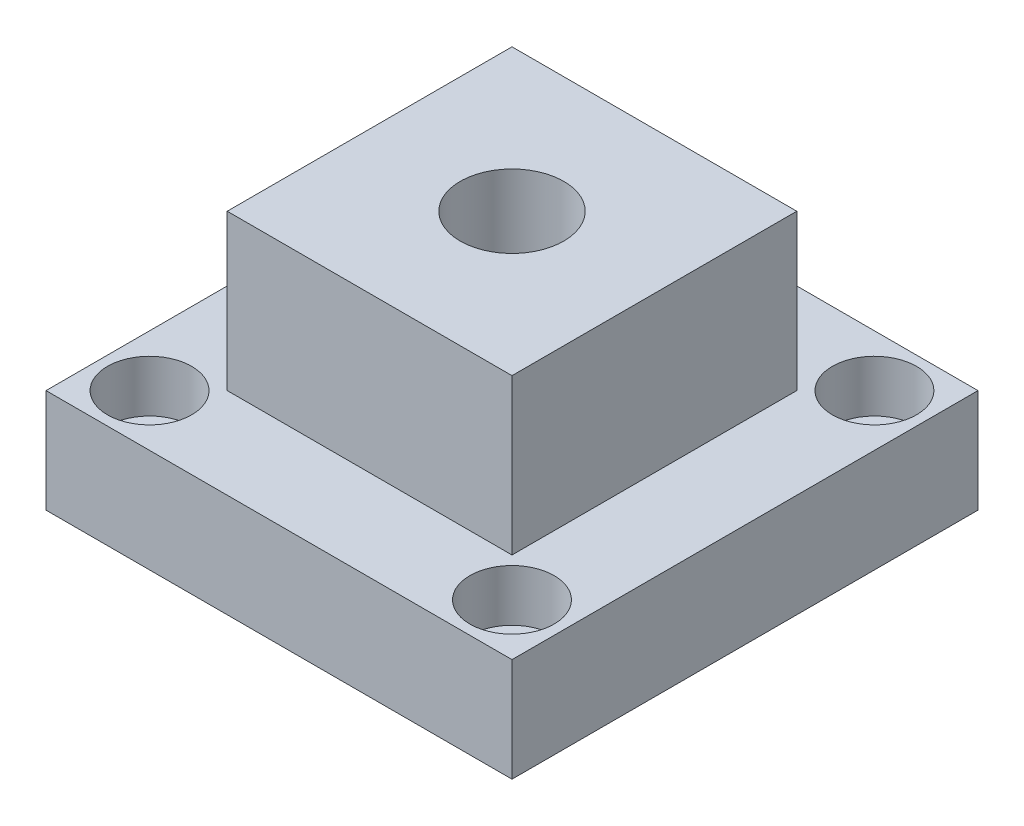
ISO-10303-21;
HEADER;
FILE_DESCRIPTION(('STEP AP214'),'2;1');
FILE_NAME('part.step','',(''),(''),'','','');
FILE_SCHEMA(('AUTOMOTIVE_DESIGN { 1 0 10303 214 1 1 1 1 }'));
ENDSEC;
DATA;
#1=APPLICATION_CONTEXT('core data for automotive mechanical design processes');
#2=APPLICATION_PROTOCOL_DEFINITION('international standard','automotive_design',2000,#1);
#3=PRODUCT_CONTEXT('',#1,'mechanical');
#4=PRODUCT('Part','Part','',(#3));
#5=PRODUCT_RELATED_PRODUCT_CATEGORY('part','',(#4));
#6=PRODUCT_DEFINITION_FORMATION('','',#4);
#7=PRODUCT_DEFINITION_CONTEXT('part definition',#1,'design');
#8=PRODUCT_DEFINITION('design','',#6,#7);
#9=PRODUCT_DEFINITION_SHAPE('','',#8);
#10=(LENGTH_UNIT() NAMED_UNIT(*) SI_UNIT(.MILLI.,.METRE.));
#11=(NAMED_UNIT(*) PLANE_ANGLE_UNIT() SI_UNIT($,.RADIAN.));
#12=(NAMED_UNIT(*) SI_UNIT($,.STERADIAN.) SOLID_ANGLE_UNIT());
#13=UNCERTAINTY_MEASURE_WITH_UNIT(LENGTH_MEASURE(1.E-05),#10,'distance_accuracy_value','');
#14=(GEOMETRIC_REPRESENTATION_CONTEXT(3) GLOBAL_UNCERTAINTY_ASSIGNED_CONTEXT((#13)) GLOBAL_UNIT_ASSIGNED_CONTEXT((#10,
#11,#12)) REPRESENTATION_CONTEXT('',''));
#15=CARTESIAN_POINT('',(0.,0.,0.));
#16=DIRECTION('',(0.,0.,1.));
#17=DIRECTION('',(1.,0.,0.));
#18=AXIS2_PLACEMENT_3D('',#15,#16,#17);
#19=CARTESIAN_POINT('',(1.38777878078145E-13,25.4,-114.300000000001));
#20=DIRECTION('',(0.,-1.,0.));
#21=DIRECTION('',(0.,0.,-1.));
#22=AXIS2_PLACEMENT_3D('',#19,#20,#21);
#23=PLANE('',#22);
#24=DIRECTION('',(0.,0.,1.));
#25=VECTOR('',#24,1.);
#26=CARTESIAN_POINT('',(0.,25.4,0.));
#27=LINE('',#26,#25);
#28=CARTESIAN_POINT('',(1.38777878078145E-13,25.4,-114.300000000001));
#29=VERTEX_POINT('',#28);
#30=CARTESIAN_POINT('',(0.,25.4,0.));
#31=VERTEX_POINT('',#30);
#32=EDGE_CURVE('E216',#29,#31,#27,.T.);
#33=ORIENTED_EDGE('',*,*,#32,.T.);
#34=DIRECTION('',(1.,0.,0.));
#35=VECTOR('',#34,1.);
#36=CARTESIAN_POINT('',(0.,25.4,0.));
#37=LINE('',#36,#35);
#38=CARTESIAN_POINT('',(114.300000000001,25.4,-1.38777878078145E-13));
#39=VERTEX_POINT('',#38);
#40=EDGE_CURVE('E219',#31,#39,#37,.T.);
#41=ORIENTED_EDGE('',*,*,#40,.T.);
#42=DIRECTION('',(0.,0.,-1.));
#43=VECTOR('',#42,1.);
#44=CARTESIAN_POINT('',(114.300000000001,25.4,-1.38777878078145E-13));
#45=LINE('',#44,#43);
#46=CARTESIAN_POINT('',(114.300000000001,25.4,-114.300000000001));
#47=VERTEX_POINT('',#46);
#48=EDGE_CURVE('E222',#39,#47,#45,.T.);
#49=ORIENTED_EDGE('',*,*,#48,.T.);
#50=DIRECTION('',(-1.,0.,0.));
#51=VECTOR('',#50,1.);
#52=CARTESIAN_POINT('',(1.38777878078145E-13,25.4,-114.300000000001));
#53=LINE('',#52,#51);
#54=EDGE_CURVE('E224',#47,#29,#53,.T.);
#55=ORIENTED_EDGE('',*,*,#54,.T.);
#56=EDGE_LOOP('',(#33,#41,#49,#55));
#57=FACE_BOUND('',#56,.T.);
#58=CARTESIAN_POINT('',(101.600000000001,25.4,-101.600000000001));
#59=DIRECTION('',(0.,1.,0.));
#60=DIRECTION('',(0.,0.,1.));
#61=AXIS2_PLACEMENT_3D('',#58,#59,#60);
#62=CIRCLE('',#61,10.31875);
#63=CARTESIAN_POINT('',(101.600000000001,25.4,-91.2812500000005));
#64=VERTEX_POINT('',#63);
#65=EDGE_CURVE('E200',#64,#64,#62,.T.);
#66=ORIENTED_EDGE('',*,*,#65,.F.);
#67=EDGE_LOOP('',(#66));
#68=FACE_BOUND('',#67,.T.);
#69=CARTESIAN_POINT('',(12.7000000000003,25.4,-101.600000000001));
#70=DIRECTION('',(0.,1.,0.));
#71=DIRECTION('',(0.,0.,1.));
#72=AXIS2_PLACEMENT_3D('',#69,#70,#71);
#73=CIRCLE('',#72,10.31875);
#74=CARTESIAN_POINT('',(12.7000000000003,25.4,-91.2812500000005));
#75=VERTEX_POINT('',#74);
#76=EDGE_CURVE('E185',#75,#75,#73,.T.);
#77=ORIENTED_EDGE('',*,*,#76,.F.);
#78=EDGE_LOOP('',(#77));
#79=FACE_BOUND('',#78,.T.);
#80=CARTESIAN_POINT('',(101.600000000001,25.4,-12.7000000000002));
#81=DIRECTION('',(0.,1.,0.));
#82=DIRECTION('',(0.,0.,1.));
#83=AXIS2_PLACEMENT_3D('',#80,#81,#82);
#84=CIRCLE('',#83,10.31875);
#85=CARTESIAN_POINT('',(101.600000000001,25.4,-2.38125000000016));
#86=VERTEX_POINT('',#85);
#87=EDGE_CURVE('E170',#86,#86,#84,.T.);
#88=ORIENTED_EDGE('',*,*,#87,.F.);
#89=EDGE_LOOP('',(#88));
#90=FACE_BOUND('',#89,.T.);
#91=CARTESIAN_POINT('',(12.7000000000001,25.4,-12.7000000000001));
#92=DIRECTION('',(0.,1.,0.));
#93=DIRECTION('',(0.,0.,1.));
#94=AXIS2_PLACEMENT_3D('',#91,#92,#93);
#95=CIRCLE('',#94,10.31875);
#96=CARTESIAN_POINT('',(12.7000000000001,25.4,-2.38125000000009));
#97=VERTEX_POINT('',#96);
#98=EDGE_CURVE('E155',#97,#97,#95,.T.);
#99=ORIENTED_EDGE('',*,*,#98,.F.);
#100=EDGE_LOOP('',(#99));
#101=FACE_BOUND('',#100,.T.);
#102=DIRECTION('',(0.,0.,1.));
#103=VECTOR('',#102,1.);
#104=CARTESIAN_POINT('',(22.2250000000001,25.4,-22.2250000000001));
#105=LINE('',#104,#103);
#106=CARTESIAN_POINT('',(22.2250000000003,25.4,-92.0750000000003));
#107=VERTEX_POINT('',#106);
#108=CARTESIAN_POINT('',(22.2250000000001,25.4,-22.2250000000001));
#109=VERTEX_POINT('',#108);
#110=EDGE_CURVE('E120',#107,#109,#105,.T.);
#111=ORIENTED_EDGE('',*,*,#110,.F.);
#112=DIRECTION('',(-1.,0.,0.));
#113=VECTOR('',#112,1.);
#114=CARTESIAN_POINT('',(22.2250000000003,25.4,-92.0750000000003));
#115=LINE('',#114,#113);
#116=CARTESIAN_POINT('',(92.0750000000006,25.4,-92.0750000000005));
#117=VERTEX_POINT('',#116);
#118=EDGE_CURVE('E134',#117,#107,#115,.T.);
#119=ORIENTED_EDGE('',*,*,#118,.F.);
#120=DIRECTION('',(0.,0.,-1.));
#121=VECTOR('',#120,1.);
#122=CARTESIAN_POINT('',(92.0750000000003,25.4,-22.2250000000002));
#123=LINE('',#122,#121);
#124=CARTESIAN_POINT('',(92.0750000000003,25.4,-22.2250000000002));
#125=VERTEX_POINT('',#124);
#126=EDGE_CURVE('E66',#125,#117,#123,.T.);
#127=ORIENTED_EDGE('',*,*,#126,.F.);
#128=DIRECTION('',(1.,0.,0.));
#129=VECTOR('',#128,1.);
#130=CARTESIAN_POINT('',(22.2250000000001,25.4,-22.2250000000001));
#131=LINE('',#130,#129);
#132=EDGE_CURVE('E61',#109,#125,#131,.T.);
#133=ORIENTED_EDGE('',*,*,#132,.F.);
#134=EDGE_LOOP('',(#111,#119,#127,#133));
#135=FACE_BOUND('',#134,.T.);
#136=ADVANCED_FACE('F46',(#57,#68,#79,#90,#101,#135),#23,.F.);
#137=CARTESIAN_POINT('',(0.,25.4,0.));
#138=DIRECTION('',(1.,0.,0.));
#139=DIRECTION('',(0.,0.,-1.));
#140=AXIS2_PLACEMENT_3D('',#137,#138,#139);
#141=PLANE('',#140);
#142=DIRECTION('',(0.,0.,1.));
#143=VECTOR('',#142,1.);
#144=CARTESIAN_POINT('',(0.,0.,0.));
#145=LINE('',#144,#143);
#146=CARTESIAN_POINT('',(1.38777878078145E-13,0.,-114.300000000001));
#147=VERTEX_POINT('',#146);
#148=CARTESIAN_POINT('',(0.,0.,0.));
#149=VERTEX_POINT('',#148);
#150=EDGE_CURVE('E215',#147,#149,#145,.T.);
#151=ORIENTED_EDGE('',*,*,#150,.T.);
#152=DIRECTION('',(0.,-1.,0.));
#153=VECTOR('',#152,1.);
#154=CARTESIAN_POINT('',(0.,25.4,0.));
#155=LINE('',#154,#153);
#156=EDGE_CURVE('E13',#31,#149,#155,.T.);
#157=ORIENTED_EDGE('',*,*,#156,.F.);
#158=ORIENTED_EDGE('',*,*,#32,.F.);
#159=DIRECTION('',(0.,-1.,0.));
#160=VECTOR('',#159,1.);
#161=CARTESIAN_POINT('',(1.38777878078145E-13,25.4,-114.300000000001));
#162=LINE('',#161,#160);
#163=EDGE_CURVE('E226',#29,#147,#162,.T.);
#164=ORIENTED_EDGE('',*,*,#163,.T.);
#165=EDGE_LOOP('',(#151,#157,#158,#164));
#166=FACE_BOUND('',#165,.T.);
#167=ADVANCED_FACE('F48',(#166),#141,.F.);
#168=CARTESIAN_POINT('',(0.,25.4,0.));
#169=DIRECTION('',(0.,0.,-1.));
#170=DIRECTION('',(-1.,0.,0.));
#171=AXIS2_PLACEMENT_3D('',#168,#169,#170);
#172=PLANE('',#171);
#173=DIRECTION('',(1.,0.,0.));
#174=VECTOR('',#173,1.);
#175=CARTESIAN_POINT('',(0.,0.,0.));
#176=LINE('',#175,#174);
#177=CARTESIAN_POINT('',(114.300000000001,0.,-1.38777878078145E-13));
#178=VERTEX_POINT('',#177);
#179=EDGE_CURVE('E229',#149,#178,#176,.T.);
#180=ORIENTED_EDGE('',*,*,#179,.T.);
#181=DIRECTION('',(0.,-1.,0.));
#182=VECTOR('',#181,1.);
#183=CARTESIAN_POINT('',(114.300000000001,25.4,-1.38777878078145E-13));
#184=LINE('',#183,#182);
#185=EDGE_CURVE('E54',#39,#178,#184,.T.);
#186=ORIENTED_EDGE('',*,*,#185,.F.);
#187=ORIENTED_EDGE('',*,*,#40,.F.);
#188=ORIENTED_EDGE('',*,*,#156,.T.);
#189=EDGE_LOOP('',(#180,#186,#187,#188));
#190=FACE_BOUND('',#189,.T.);
#191=ADVANCED_FACE('F259',(#190),#172,.F.);
#192=CARTESIAN_POINT('',(114.300000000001,25.4,-1.38777878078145E-13));
#193=DIRECTION('',(-1.,0.,0.));
#194=DIRECTION('',(0.,0.,1.));
#195=AXIS2_PLACEMENT_3D('',#192,#193,#194);
#196=PLANE('',#195);
#197=DIRECTION('',(0.,0.,-1.));
#198=VECTOR('',#197,1.);
#199=CARTESIAN_POINT('',(114.300000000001,0.,-1.38777878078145E-13));
#200=LINE('',#199,#198);
#201=CARTESIAN_POINT('',(114.300000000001,0.,-114.300000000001));
#202=VERTEX_POINT('',#201);
#203=EDGE_CURVE('E231',#178,#202,#200,.T.);
#204=ORIENTED_EDGE('',*,*,#203,.T.);
#205=DIRECTION('',(0.,-1.,0.));
#206=VECTOR('',#205,1.);
#207=CARTESIAN_POINT('',(114.300000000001,25.4,-114.300000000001));
#208=LINE('',#207,#206);
#209=EDGE_CURVE('E236',#47,#202,#208,.T.);
#210=ORIENTED_EDGE('',*,*,#209,.F.);
#211=ORIENTED_EDGE('',*,*,#48,.F.);
#212=ORIENTED_EDGE('',*,*,#185,.T.);
#213=EDGE_LOOP('',(#204,#210,#211,#212));
#214=FACE_BOUND('',#213,.T.);
#215=ADVANCED_FACE('F243',(#214),#196,.F.);
#216=CARTESIAN_POINT('',(1.38777878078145E-13,25.4,-114.300000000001));
#217=DIRECTION('',(0.,0.,1.));
#218=DIRECTION('',(1.,0.,0.));
#219=AXIS2_PLACEMENT_3D('',#216,#217,#218);
#220=PLANE('',#219);
#221=DIRECTION('',(-1.,0.,0.));
#222=VECTOR('',#221,1.);
#223=CARTESIAN_POINT('',(1.38777878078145E-13,0.,-114.300000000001));
#224=LINE('',#223,#222);
#225=EDGE_CURVE('E220',#202,#147,#224,.T.);
#226=ORIENTED_EDGE('',*,*,#225,.T.);
#227=ORIENTED_EDGE('',*,*,#163,.F.);
#228=ORIENTED_EDGE('',*,*,#54,.F.);
#229=ORIENTED_EDGE('',*,*,#209,.T.);
#230=EDGE_LOOP('',(#226,#227,#228,#229));
#231=FACE_BOUND('',#230,.T.);
#232=ADVANCED_FACE('F252',(#231),#220,.F.);
#233=CARTESIAN_POINT('',(1.38777878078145E-13,0.,-114.300000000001));
#234=DIRECTION('',(0.,-1.,0.));
#235=DIRECTION('',(0.,0.,-1.));
#236=AXIS2_PLACEMENT_3D('',#233,#234,#235);
#237=PLANE('',#236);
#238=CARTESIAN_POINT('',(12.7000000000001,0.,-12.7000000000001));
#239=DIRECTION('',(0.,1.,0.));
#240=DIRECTION('',(0.,0.,1.));
#241=AXIS2_PLACEMENT_3D('',#238,#239,#240);
#242=CIRCLE('',#241,7.58062999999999);
#243=CARTESIAN_POINT('',(12.7000000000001,0.,-5.11937000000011));
#244=VERTEX_POINT('',#243);
#245=EDGE_CURVE('E167',#244,#244,#242,.T.);
#246=ORIENTED_EDGE('',*,*,#245,.T.);
#247=EDGE_LOOP('',(#246));
#248=FACE_BOUND('',#247,.T.);
#249=CARTESIAN_POINT('',(101.600000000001,0.,-12.7000000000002));
#250=DIRECTION('',(0.,1.,0.));
#251=DIRECTION('',(0.,0.,1.));
#252=AXIS2_PLACEMENT_3D('',#249,#250,#251);
#253=CIRCLE('',#252,7.58062999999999);
#254=CARTESIAN_POINT('',(101.600000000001,0.,-5.11937000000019));
#255=VERTEX_POINT('',#254);
#256=EDGE_CURVE('E182',#255,#255,#253,.T.);
#257=ORIENTED_EDGE('',*,*,#256,.T.);
#258=EDGE_LOOP('',(#257));
#259=FACE_BOUND('',#258,.T.);
#260=CARTESIAN_POINT('',(12.7000000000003,0.,-101.600000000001));
#261=DIRECTION('',(0.,1.,0.));
#262=DIRECTION('',(0.,0.,1.));
#263=AXIS2_PLACEMENT_3D('',#260,#261,#262);
#264=CIRCLE('',#263,7.58062999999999);
#265=CARTESIAN_POINT('',(12.7000000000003,0.,-94.0193700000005));
#266=VERTEX_POINT('',#265);
#267=EDGE_CURVE('E197',#266,#266,#264,.T.);
#268=ORIENTED_EDGE('',*,*,#267,.T.);
#269=EDGE_LOOP('',(#268));
#270=FACE_BOUND('',#269,.T.);
#271=CARTESIAN_POINT('',(101.600000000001,0.,-101.600000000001));
#272=DIRECTION('',(0.,1.,0.));
#273=DIRECTION('',(0.,0.,1.));
#274=AXIS2_PLACEMENT_3D('',#271,#272,#273);
#275=CIRCLE('',#274,7.58062999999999);
#276=CARTESIAN_POINT('',(101.600000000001,0.,-94.0193700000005));
#277=VERTEX_POINT('',#276);
#278=EDGE_CURVE('E212',#277,#277,#275,.T.);
#279=ORIENTED_EDGE('',*,*,#278,.T.);
#280=EDGE_LOOP('',(#279));
#281=FACE_BOUND('',#280,.T.);
#282=ORIENTED_EDGE('',*,*,#150,.F.);
#283=ORIENTED_EDGE('',*,*,#225,.F.);
#284=ORIENTED_EDGE('',*,*,#203,.F.);
#285=ORIENTED_EDGE('',*,*,#179,.F.);
#286=EDGE_LOOP('',(#282,#283,#284,#285));
#287=FACE_BOUND('',#286,.T.);
#288=ADVANCED_FACE('F249',(#248,#259,#270,#281,#287),#237,.T.);
#289=CARTESIAN_POINT('',(101.600000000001,0.634999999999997,-101.600000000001));
#290=DIRECTION('',(0.,-1.,0.));
#291=DIRECTION('',(0.,0.,-1.));
#292=AXIS2_PLACEMENT_3D('',#289,#290,#291);
#293=CONICAL_SURFACE('',#292,6.94562999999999,0.78539816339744);
#294=ORIENTED_EDGE('',*,*,#278,.F.);
#295=EDGE_LOOP('',(#294));
#296=FACE_BOUND('',#295,.T.);
#297=CARTESIAN_POINT('',(101.600000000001,0.634999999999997,-101.600000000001));
#298=DIRECTION('',(0.,1.,0.));
#299=DIRECTION('',(0.,0.,1.));
#300=AXIS2_PLACEMENT_3D('',#297,#298,#299);
#301=CIRCLE('',#300,6.94562999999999);
#302=CARTESIAN_POINT('',(101.600000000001,0.634999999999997,-94.6543700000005));
#303=VERTEX_POINT('',#302);
#304=EDGE_CURVE('E209',#303,#303,#301,.T.);
#305=ORIENTED_EDGE('',*,*,#304,.T.);
#306=EDGE_LOOP('',(#305));
#307=FACE_BOUND('',#306,.T.);
#308=ADVANCED_FACE('F272',(#296,#307),#293,.F.);
#309=CARTESIAN_POINT('',(101.600000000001,25.4,-101.600000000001));
#310=DIRECTION('',(0.,1.,0.));
#311=DIRECTION('',(0.,0.,1.));
#312=AXIS2_PLACEMENT_3D('',#309,#310,#311);
#313=CYLINDRICAL_SURFACE('',#312,6.94562999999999);
#314=ORIENTED_EDGE('',*,*,#304,.F.);
#315=EDGE_LOOP('',(#314));
#316=FACE_BOUND('',#315,.T.);
#317=CARTESIAN_POINT('',(101.600000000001,12.7,-101.600000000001));
#318=DIRECTION('',(0.,1.,0.));
#319=DIRECTION('',(0.,0.,1.));
#320=AXIS2_PLACEMENT_3D('',#317,#318,#319);
#321=CIRCLE('',#320,6.94562999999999);
#322=CARTESIAN_POINT('',(101.600000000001,12.7,-94.6543700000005));
#323=VERTEX_POINT('',#322);
#324=EDGE_CURVE('E206',#323,#323,#321,.T.);
#325=ORIENTED_EDGE('',*,*,#324,.T.);
#326=EDGE_LOOP('',(#325));
#327=FACE_BOUND('',#326,.T.);
#328=ADVANCED_FACE('F292',(#316,#327),#313,.F.);
#329=CARTESIAN_POINT('',(108.545630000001,12.7,-101.600000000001));
#330=DIRECTION('',(0.,-1.,0.));
#331=DIRECTION('',(0.,0.,-1.));
#332=AXIS2_PLACEMENT_3D('',#329,#330,#331);
#333=PLANE('',#332);
#334=ORIENTED_EDGE('',*,*,#324,.F.);
#335=EDGE_LOOP('',(#334));
#336=FACE_BOUND('',#335,.T.);
#337=CARTESIAN_POINT('',(101.600000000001,12.7,-101.600000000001));
#338=DIRECTION('',(0.,1.,0.));
#339=DIRECTION('',(0.,0.,1.));
#340=AXIS2_PLACEMENT_3D('',#337,#338,#339);
#341=CIRCLE('',#340,10.31875);
#342=CARTESIAN_POINT('',(101.600000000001,12.7,-91.2812500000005));
#343=VERTEX_POINT('',#342);
#344=EDGE_CURVE('E203',#343,#343,#341,.T.);
#345=ORIENTED_EDGE('',*,*,#344,.T.);
#346=EDGE_LOOP('',(#345));
#347=FACE_BOUND('',#346,.T.);
#348=ADVANCED_FACE('F299',(#336,#347),#333,.F.);
#349=CARTESIAN_POINT('',(101.600000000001,25.4,-101.600000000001));
#350=DIRECTION('',(0.,1.,0.));
#351=DIRECTION('',(0.,0.,1.));
#352=AXIS2_PLACEMENT_3D('',#349,#350,#351);
#353=CYLINDRICAL_SURFACE('',#352,10.31875);
#354=ORIENTED_EDGE('',*,*,#344,.F.);
#355=EDGE_LOOP('',(#354));
#356=FACE_BOUND('',#355,.T.);
#357=ORIENTED_EDGE('',*,*,#65,.T.);
#358=EDGE_LOOP('',(#357));
#359=FACE_BOUND('',#358,.T.);
#360=ADVANCED_FACE('F306',(#356,#359),#353,.F.);
#361=CARTESIAN_POINT('',(12.7000000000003,0.634999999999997,-101.600000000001));
#362=DIRECTION('',(0.,-1.,0.));
#363=DIRECTION('',(0.,0.,-1.));
#364=AXIS2_PLACEMENT_3D('',#361,#362,#363);
#365=CONICAL_SURFACE('',#364,6.94562999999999,0.785398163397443);
#366=ORIENTED_EDGE('',*,*,#267,.F.);
#367=EDGE_LOOP('',(#366));
#368=FACE_BOUND('',#367,.T.);
#369=CARTESIAN_POINT('',(12.7000000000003,0.634999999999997,-101.600000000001));
#370=DIRECTION('',(0.,1.,0.));
#371=DIRECTION('',(0.,0.,1.));
#372=AXIS2_PLACEMENT_3D('',#369,#370,#371);
#373=CIRCLE('',#372,6.94562999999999);
#374=CARTESIAN_POINT('',(12.7000000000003,0.634999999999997,-94.6543700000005));
#375=VERTEX_POINT('',#374);
#376=EDGE_CURVE('E194',#375,#375,#373,.T.);
#377=ORIENTED_EDGE('',*,*,#376,.T.);
#378=EDGE_LOOP('',(#377));
#379=FACE_BOUND('',#378,.T.);
#380=ADVANCED_FACE('F314',(#368,#379),#365,.F.);
#381=CARTESIAN_POINT('',(12.7000000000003,25.4,-101.600000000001));
#382=DIRECTION('',(0.,1.,0.));
#383=DIRECTION('',(0.,0.,1.));
#384=AXIS2_PLACEMENT_3D('',#381,#382,#383);
#385=CYLINDRICAL_SURFACE('',#384,6.94563);
#386=ORIENTED_EDGE('',*,*,#376,.F.);
#387=EDGE_LOOP('',(#386));
#388=FACE_BOUND('',#387,.T.);
#389=CARTESIAN_POINT('',(12.7000000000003,12.7,-101.600000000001));
#390=DIRECTION('',(0.,1.,0.));
#391=DIRECTION('',(0.,0.,1.));
#392=AXIS2_PLACEMENT_3D('',#389,#390,#391);
#393=CIRCLE('',#392,6.94563);
#394=CARTESIAN_POINT('',(12.7000000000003,12.7,-94.6543700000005));
#395=VERTEX_POINT('',#394);
#396=EDGE_CURVE('E191',#395,#395,#393,.T.);
#397=ORIENTED_EDGE('',*,*,#396,.T.);
#398=EDGE_LOOP('',(#397));
#399=FACE_BOUND('',#398,.T.);
#400=ADVANCED_FACE('F322',(#388,#399),#385,.F.);
#401=CARTESIAN_POINT('',(19.6456300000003,12.7,-101.600000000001));
#402=DIRECTION('',(0.,-1.,0.));
#403=DIRECTION('',(0.,0.,-1.));
#404=AXIS2_PLACEMENT_3D('',#401,#402,#403);
#405=PLANE('',#404);
#406=ORIENTED_EDGE('',*,*,#396,.F.);
#407=EDGE_LOOP('',(#406));
#408=FACE_BOUND('',#407,.T.);
#409=CARTESIAN_POINT('',(12.7000000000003,12.7,-101.600000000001));
#410=DIRECTION('',(0.,1.,0.));
#411=DIRECTION('',(0.,0.,1.));
#412=AXIS2_PLACEMENT_3D('',#409,#410,#411);
#413=CIRCLE('',#412,10.31875);
#414=CARTESIAN_POINT('',(12.7000000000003,12.7,-91.2812500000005));
#415=VERTEX_POINT('',#414);
#416=EDGE_CURVE('E188',#415,#415,#413,.T.);
#417=ORIENTED_EDGE('',*,*,#416,.T.);
#418=EDGE_LOOP('',(#417));
#419=FACE_BOUND('',#418,.T.);
#420=ADVANCED_FACE('F330',(#408,#419),#405,.F.);
#421=CARTESIAN_POINT('',(12.7000000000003,25.4,-101.600000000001));
#422=DIRECTION('',(0.,1.,0.));
#423=DIRECTION('',(0.,0.,1.));
#424=AXIS2_PLACEMENT_3D('',#421,#422,#423);
#425=CYLINDRICAL_SURFACE('',#424,10.31875);
#426=ORIENTED_EDGE('',*,*,#416,.F.);
#427=EDGE_LOOP('',(#426));
#428=FACE_BOUND('',#427,.T.);
#429=ORIENTED_EDGE('',*,*,#76,.T.);
#430=EDGE_LOOP('',(#429));
#431=FACE_BOUND('',#430,.T.);
#432=ADVANCED_FACE('F338',(#428,#431),#425,.F.);
#433=CARTESIAN_POINT('',(101.600000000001,0.634999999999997,-12.7000000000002));
#434=DIRECTION('',(0.,-1.,0.));
#435=DIRECTION('',(0.,0.,-1.));
#436=AXIS2_PLACEMENT_3D('',#433,#434,#435);
#437=CONICAL_SURFACE('',#436,6.94562999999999,0.78539816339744);
#438=ORIENTED_EDGE('',*,*,#256,.F.);
#439=EDGE_LOOP('',(#438));
#440=FACE_BOUND('',#439,.T.);
#441=CARTESIAN_POINT('',(101.600000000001,0.634999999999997,-12.7000000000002));
#442=DIRECTION('',(0.,1.,0.));
#443=DIRECTION('',(0.,0.,1.));
#444=AXIS2_PLACEMENT_3D('',#441,#442,#443);
#445=CIRCLE('',#444,6.94562999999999);
#446=CARTESIAN_POINT('',(101.600000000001,0.634999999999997,-5.75437000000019));
#447=VERTEX_POINT('',#446);
#448=EDGE_CURVE('E179',#447,#447,#445,.T.);
#449=ORIENTED_EDGE('',*,*,#448,.T.);
#450=EDGE_LOOP('',(#449));
#451=FACE_BOUND('',#450,.T.);
#452=ADVANCED_FACE('F346',(#440,#451),#437,.F.);
#453=CARTESIAN_POINT('',(101.600000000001,25.4,-12.7000000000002));
#454=DIRECTION('',(0.,1.,0.));
#455=DIRECTION('',(0.,0.,1.));
#456=AXIS2_PLACEMENT_3D('',#453,#454,#455);
#457=CYLINDRICAL_SURFACE('',#456,6.94562999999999);
#458=ORIENTED_EDGE('',*,*,#448,.F.);
#459=EDGE_LOOP('',(#458));
#460=FACE_BOUND('',#459,.T.);
#461=CARTESIAN_POINT('',(101.600000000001,12.7,-12.7000000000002));
#462=DIRECTION('',(0.,1.,0.));
#463=DIRECTION('',(0.,0.,1.));
#464=AXIS2_PLACEMENT_3D('',#461,#462,#463);
#465=CIRCLE('',#464,6.94562999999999);
#466=CARTESIAN_POINT('',(101.600000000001,12.7,-5.75437000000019));
#467=VERTEX_POINT('',#466);
#468=EDGE_CURVE('E176',#467,#467,#465,.T.);
#469=ORIENTED_EDGE('',*,*,#468,.T.);
#470=EDGE_LOOP('',(#469));
#471=FACE_BOUND('',#470,.T.);
#472=ADVANCED_FACE('F354',(#460,#471),#457,.F.);
#473=CARTESIAN_POINT('',(108.545630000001,12.7,-12.7000000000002));
#474=DIRECTION('',(0.,-1.,0.));
#475=DIRECTION('',(0.,0.,-1.));
#476=AXIS2_PLACEMENT_3D('',#473,#474,#475);
#477=PLANE('',#476);
#478=ORIENTED_EDGE('',*,*,#468,.F.);
#479=EDGE_LOOP('',(#478));
#480=FACE_BOUND('',#479,.T.);
#481=CARTESIAN_POINT('',(101.600000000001,12.7,-12.7000000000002));
#482=DIRECTION('',(0.,1.,0.));
#483=DIRECTION('',(0.,0.,1.));
#484=AXIS2_PLACEMENT_3D('',#481,#482,#483);
#485=CIRCLE('',#484,10.31875);
#486=CARTESIAN_POINT('',(101.600000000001,12.7,-2.38125000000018));
#487=VERTEX_POINT('',#486);
#488=EDGE_CURVE('E173',#487,#487,#485,.T.);
#489=ORIENTED_EDGE('',*,*,#488,.T.);
#490=EDGE_LOOP('',(#489));
#491=FACE_BOUND('',#490,.T.);
#492=ADVANCED_FACE('F362',(#480,#491),#477,.F.);
#493=CARTESIAN_POINT('',(101.600000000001,25.4,-12.7000000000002));
#494=DIRECTION('',(0.,1.,0.));
#495=DIRECTION('',(0.,0.,1.));
#496=AXIS2_PLACEMENT_3D('',#493,#494,#495);
#497=CYLINDRICAL_SURFACE('',#496,10.31875);
#498=ORIENTED_EDGE('',*,*,#488,.F.);
#499=EDGE_LOOP('',(#498));
#500=FACE_BOUND('',#499,.T.);
#501=ORIENTED_EDGE('',*,*,#87,.T.);
#502=EDGE_LOOP('',(#501));
#503=FACE_BOUND('',#502,.T.);
#504=ADVANCED_FACE('F370',(#500,#503),#497,.F.);
#505=CARTESIAN_POINT('',(12.7000000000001,0.634999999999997,-12.7000000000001));
#506=DIRECTION('',(0.,-1.,0.));
#507=DIRECTION('',(0.,0.,-1.));
#508=AXIS2_PLACEMENT_3D('',#505,#506,#507);
#509=CONICAL_SURFACE('',#508,6.94562999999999,0.785398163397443);
#510=ORIENTED_EDGE('',*,*,#245,.F.);
#511=EDGE_LOOP('',(#510));
#512=FACE_BOUND('',#511,.T.);
#513=CARTESIAN_POINT('',(12.7000000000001,0.634999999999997,-12.7000000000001));
#514=DIRECTION('',(0.,1.,0.));
#515=DIRECTION('',(0.,0.,1.));
#516=AXIS2_PLACEMENT_3D('',#513,#514,#515);
#517=CIRCLE('',#516,6.94562999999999);
#518=CARTESIAN_POINT('',(12.7000000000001,0.634999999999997,-5.75437000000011));
#519=VERTEX_POINT('',#518);
#520=EDGE_CURVE('E164',#519,#519,#517,.T.);
#521=ORIENTED_EDGE('',*,*,#520,.T.);
#522=EDGE_LOOP('',(#521));
#523=FACE_BOUND('',#522,.T.);
#524=ADVANCED_FACE('F378',(#512,#523),#509,.F.);
#525=CARTESIAN_POINT('',(12.7000000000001,25.4,-12.7000000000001));
#526=DIRECTION('',(0.,1.,0.));
#527=DIRECTION('',(0.,0.,1.));
#528=AXIS2_PLACEMENT_3D('',#525,#526,#527);
#529=CYLINDRICAL_SURFACE('',#528,6.94563);
#530=ORIENTED_EDGE('',*,*,#520,.F.);
#531=EDGE_LOOP('',(#530));
#532=FACE_BOUND('',#531,.T.);
#533=CARTESIAN_POINT('',(12.7000000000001,12.7,-12.7000000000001));
#534=DIRECTION('',(0.,1.,0.));
#535=DIRECTION('',(0.,0.,1.));
#536=AXIS2_PLACEMENT_3D('',#533,#534,#535);
#537=CIRCLE('',#536,6.94563);
#538=CARTESIAN_POINT('',(12.7000000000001,12.7,-5.75437000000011));
#539=VERTEX_POINT('',#538);
#540=EDGE_CURVE('E161',#539,#539,#537,.T.);
#541=ORIENTED_EDGE('',*,*,#540,.T.);
#542=EDGE_LOOP('',(#541));
#543=FACE_BOUND('',#542,.T.);
#544=ADVANCED_FACE('F386',(#532,#543),#529,.F.);
#545=CARTESIAN_POINT('',(19.6456300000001,12.7,-12.7000000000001));
#546=DIRECTION('',(0.,-1.,0.));
#547=DIRECTION('',(0.,0.,-1.));
#548=AXIS2_PLACEMENT_3D('',#545,#546,#547);
#549=PLANE('',#548);
#550=ORIENTED_EDGE('',*,*,#540,.F.);
#551=EDGE_LOOP('',(#550));
#552=FACE_BOUND('',#551,.T.);
#553=CARTESIAN_POINT('',(12.7000000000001,12.7,-12.7000000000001));
#554=DIRECTION('',(0.,1.,0.));
#555=DIRECTION('',(0.,0.,1.));
#556=AXIS2_PLACEMENT_3D('',#553,#554,#555);
#557=CIRCLE('',#556,10.31875);
#558=CARTESIAN_POINT('',(12.7000000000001,12.7,-2.3812500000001));
#559=VERTEX_POINT('',#558);
#560=EDGE_CURVE('E158',#559,#559,#557,.T.);
#561=ORIENTED_EDGE('',*,*,#560,.T.);
#562=EDGE_LOOP('',(#561));
#563=FACE_BOUND('',#562,.T.);
#564=ADVANCED_FACE('F394',(#552,#563),#549,.F.);
#565=CARTESIAN_POINT('',(12.7000000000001,25.4,-12.7000000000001));
#566=DIRECTION('',(0.,1.,0.));
#567=DIRECTION('',(0.,0.,1.));
#568=AXIS2_PLACEMENT_3D('',#565,#566,#567);
#569=CYLINDRICAL_SURFACE('',#568,10.31875);
#570=ORIENTED_EDGE('',*,*,#560,.F.);
#571=EDGE_LOOP('',(#570));
#572=FACE_BOUND('',#571,.T.);
#573=ORIENTED_EDGE('',*,*,#98,.T.);
#574=EDGE_LOOP('',(#573));
#575=FACE_BOUND('',#574,.T.);
#576=ADVANCED_FACE('F402',(#572,#575),#569,.F.);
#577=CARTESIAN_POINT('',(22.2250000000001,63.5,-22.2250000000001));
#578=DIRECTION('',(1.,0.,0.));
#579=DIRECTION('',(0.,0.,-1.));
#580=AXIS2_PLACEMENT_3D('',#577,#578,#579);
#581=PLANE('',#580);
#582=ORIENTED_EDGE('',*,*,#110,.T.);
#583=DIRECTION('',(0.,-1.,0.));
#584=VECTOR('',#583,1.);
#585=CARTESIAN_POINT('',(22.2250000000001,63.5,-22.2250000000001));
#586=LINE('',#585,#584);
#587=CARTESIAN_POINT('',(22.2250000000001,63.5,-22.2250000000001));
#588=VERTEX_POINT('',#587);
#589=EDGE_CURVE('E153',#588,#109,#586,.T.);
#590=ORIENTED_EDGE('',*,*,#589,.F.);
#591=DIRECTION('',(0.,0.,1.));
#592=VECTOR('',#591,1.);
#593=CARTESIAN_POINT('',(22.2250000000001,63.5,-22.2250000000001));
#594=LINE('',#593,#592);
#595=CARTESIAN_POINT('',(22.2250000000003,63.5,-92.0750000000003));
#596=VERTEX_POINT('',#595);
#597=EDGE_CURVE('E130',#596,#588,#594,.T.);
#598=ORIENTED_EDGE('',*,*,#597,.F.);
#599=DIRECTION('',(0.,-1.,0.));
#600=VECTOR('',#599,1.);
#601=CARTESIAN_POINT('',(22.2250000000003,63.5,-92.0750000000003));
#602=LINE('',#601,#600);
#603=EDGE_CURVE('E139',#596,#107,#602,.T.);
#604=ORIENTED_EDGE('',*,*,#603,.T.);
#605=EDGE_LOOP('',(#582,#590,#598,#604));
#606=FACE_BOUND('',#605,.T.);
#607=ADVANCED_FACE('F410',(#606),#581,.F.);
#608=CARTESIAN_POINT('',(22.2250000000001,63.5,-22.2250000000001));
#609=DIRECTION('',(0.,0.,-1.));
#610=DIRECTION('',(-1.,0.,0.));
#611=AXIS2_PLACEMENT_3D('',#608,#609,#610);
#612=PLANE('',#611);
#613=ORIENTED_EDGE('',*,*,#132,.T.);
#614=DIRECTION('',(0.,-1.,0.));
#615=VECTOR('',#614,1.);
#616=CARTESIAN_POINT('',(92.0750000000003,63.5,-22.2250000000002));
#617=LINE('',#616,#615);
#618=CARTESIAN_POINT('',(92.0750000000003,63.5,-22.2250000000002));
#619=VERTEX_POINT('',#618);
#620=EDGE_CURVE('E150',#619,#125,#617,.T.);
#621=ORIENTED_EDGE('',*,*,#620,.F.);
#622=DIRECTION('',(1.,0.,0.));
#623=VECTOR('',#622,1.);
#624=CARTESIAN_POINT('',(22.2250000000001,63.5,-22.2250000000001));
#625=LINE('',#624,#623);
#626=EDGE_CURVE('E133',#588,#619,#625,.T.);
#627=ORIENTED_EDGE('',*,*,#626,.F.);
#628=ORIENTED_EDGE('',*,*,#589,.T.);
#629=EDGE_LOOP('',(#613,#621,#627,#628));
#630=FACE_BOUND('',#629,.T.);
#631=ADVANCED_FACE('F418',(#630),#612,.F.);
#632=CARTESIAN_POINT('',(92.0750000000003,63.5,-22.2250000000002));
#633=DIRECTION('',(-1.,0.,0.));
#634=DIRECTION('',(0.,0.,1.));
#635=AXIS2_PLACEMENT_3D('',#632,#633,#634);
#636=PLANE('',#635);
#637=ORIENTED_EDGE('',*,*,#126,.T.);
#638=DIRECTION('',(0.,-1.,0.));
#639=VECTOR('',#638,1.);
#640=CARTESIAN_POINT('',(92.0750000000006,63.5,-92.0750000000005));
#641=LINE('',#640,#639);
#642=CARTESIAN_POINT('',(92.0750000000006,63.5,-92.0750000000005));
#643=VERTEX_POINT('',#642);
#644=EDGE_CURVE('E147',#643,#117,#641,.T.);
#645=ORIENTED_EDGE('',*,*,#644,.F.);
#646=DIRECTION('',(0.,0.,-1.));
#647=VECTOR('',#646,1.);
#648=CARTESIAN_POINT('',(92.0750000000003,63.5,-22.2250000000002));
#649=LINE('',#648,#647);
#650=EDGE_CURVE('E136',#619,#643,#649,.T.);
#651=ORIENTED_EDGE('',*,*,#650,.F.);
#652=ORIENTED_EDGE('',*,*,#620,.T.);
#653=EDGE_LOOP('',(#637,#645,#651,#652));
#654=FACE_BOUND('',#653,.T.);
#655=ADVANCED_FACE('F426',(#654),#636,.F.);
#656=CARTESIAN_POINT('',(22.2250000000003,63.5,-92.0750000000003));
#657=DIRECTION('',(0.,0.,1.));
#658=DIRECTION('',(1.,0.,0.));
#659=AXIS2_PLACEMENT_3D('',#656,#657,#658);
#660=PLANE('',#659);
#661=ORIENTED_EDGE('',*,*,#118,.T.);
#662=ORIENTED_EDGE('',*,*,#603,.F.);
#663=DIRECTION('',(-1.,0.,0.));
#664=VECTOR('',#663,1.);
#665=CARTESIAN_POINT('',(22.2250000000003,63.5,-92.0750000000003));
#666=LINE('',#665,#664);
#667=EDGE_CURVE('E138',#643,#596,#666,.T.);
#668=ORIENTED_EDGE('',*,*,#667,.F.);
#669=ORIENTED_EDGE('',*,*,#644,.T.);
#670=EDGE_LOOP('',(#661,#662,#668,#669));
#671=FACE_BOUND('',#670,.T.);
#672=ADVANCED_FACE('F434',(#671),#660,.F.);
#673=CARTESIAN_POINT('',(22.2250000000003,63.5,-92.0750000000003));
#674=DIRECTION('',(0.,-1.,0.));
#675=DIRECTION('',(0.,0.,-1.));
#676=AXIS2_PLACEMENT_3D('',#673,#674,#675);
#677=PLANE('',#676);
#678=CARTESIAN_POINT('',(57.1500000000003,63.5,-57.1500000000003));
#679=DIRECTION('',(0.,1.,0.));
#680=DIRECTION('',(0.,0.,1.));
#681=AXIS2_PLACEMENT_3D('',#678,#679,#680);
#682=CIRCLE('',#681,12.7);
#683=CARTESIAN_POINT('',(57.1500000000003,63.5,-44.4500000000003));
#684=VERTEX_POINT('',#683);
#685=EDGE_CURVE('E555',#684,#684,#682,.T.);
#686=ORIENTED_EDGE('',*,*,#685,.F.);
#687=EDGE_LOOP('',(#686));
#688=FACE_BOUND('',#687,.T.);
#689=ORIENTED_EDGE('',*,*,#597,.T.);
#690=ORIENTED_EDGE('',*,*,#626,.T.);
#691=ORIENTED_EDGE('',*,*,#650,.T.);
#692=ORIENTED_EDGE('',*,*,#667,.T.);
#693=EDGE_LOOP('',(#689,#690,#691,#692));
#694=FACE_BOUND('',#693,.T.);
#695=ADVANCED_FACE('F114',(#688,#694),#677,.F.);
#696=CARTESIAN_POINT('',(57.1500000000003,31.75254,-57.1500000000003));
#697=DIRECTION('',(0.,1.,0.));
#698=DIRECTION('',(0.,0.,1.));
#699=AXIS2_PLACEMENT_3D('',#696,#697,#698);
#700=CONICAL_SURFACE('',#699,11.70813,1.02974425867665);
#701=CARTESIAN_POINT('',(57.1500000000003,24.7175857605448,-57.1500000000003));
#702=VERTEX_POINT('',#701);
#703=VERTEX_LOOP('',#702);
#704=FACE_BOUND('',#703,.T.);
#705=CARTESIAN_POINT('',(57.1500000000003,31.75254,-57.1500000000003));
#706=DIRECTION('',(0.,1.,0.));
#707=DIRECTION('',(0.,0.,1.));
#708=AXIS2_PLACEMENT_3D('',#705,#706,#707);
#709=CIRCLE('',#708,11.70813);
#710=CARTESIAN_POINT('',(57.1500000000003,31.75254,-45.4418700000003));
#711=VERTEX_POINT('',#710);
#712=EDGE_CURVE('E118',#711,#711,#709,.T.);
#713=ORIENTED_EDGE('',*,*,#712,.T.);
#714=EDGE_LOOP('',(#713));
#715=FACE_BOUND('',#714,.T.);
#716=ADVANCED_FACE('F110',(#704,#715),#700,.F.);
#717=CARTESIAN_POINT('',(57.1500000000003,63.5,-57.1500000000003));
#718=DIRECTION('',(0.,1.,0.));
#719=DIRECTION('',(0.,0.,1.));
#720=AXIS2_PLACEMENT_3D('',#717,#718,#719);
#721=CYLINDRICAL_SURFACE('',#720,11.70813);
#722=ORIENTED_EDGE('',*,*,#712,.F.);
#723=EDGE_LOOP('',(#722));
#724=FACE_BOUND('',#723,.T.);
#725=CARTESIAN_POINT('',(57.1500000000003,38.1,-57.1500000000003));
#726=DIRECTION('',(0.,1.,0.));
#727=DIRECTION('',(0.,0.,1.));
#728=AXIS2_PLACEMENT_3D('',#725,#726,#727);
#729=CIRCLE('',#728,11.70813);
#730=CARTESIAN_POINT('',(57.1500000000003,38.1,-45.4418700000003));
#731=VERTEX_POINT('',#730);
#732=EDGE_CURVE('E121',#731,#731,#729,.T.);
#733=ORIENTED_EDGE('',*,*,#732,.T.);
#734=EDGE_LOOP('',(#733));
#735=FACE_BOUND('',#734,.T.);
#736=ADVANCED_FACE('F113',(#724,#735),#721,.F.);
#737=CARTESIAN_POINT('',(68.8581300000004,38.1,-57.1500000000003));
#738=DIRECTION('',(0.,-1.,0.));
#739=DIRECTION('',(0.,0.,-1.));
#740=AXIS2_PLACEMENT_3D('',#737,#738,#739);
#741=PLANE('',#740);
#742=ORIENTED_EDGE('',*,*,#732,.F.);
#743=EDGE_LOOP('',(#742));
#744=FACE_BOUND('',#743,.T.);
#745=CARTESIAN_POINT('',(57.1500000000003,38.1,-57.1500000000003));
#746=DIRECTION('',(0.,1.,0.));
#747=DIRECTION('',(0.,0.,1.));
#748=AXIS2_PLACEMENT_3D('',#745,#746,#747);
#749=CIRCLE('',#748,12.7);
#750=CARTESIAN_POINT('',(57.1500000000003,38.1,-44.4500000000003));
#751=VERTEX_POINT('',#750);
#752=EDGE_CURVE('E126',#751,#751,#749,.T.);
#753=ORIENTED_EDGE('',*,*,#752,.T.);
#754=EDGE_LOOP('',(#753));
#755=FACE_BOUND('',#754,.T.);
#756=ADVANCED_FACE('F460',(#744,#755),#741,.F.);
#757=CARTESIAN_POINT('',(57.1500000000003,63.5,-57.1500000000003));
#758=DIRECTION('',(0.,1.,0.));
#759=DIRECTION('',(0.,0.,1.));
#760=AXIS2_PLACEMENT_3D('',#757,#758,#759);
#761=CYLINDRICAL_SURFACE('',#760,12.7);
#762=ORIENTED_EDGE('',*,*,#752,.F.);
#763=EDGE_LOOP('',(#762));
#764=FACE_BOUND('',#763,.T.);
#765=ORIENTED_EDGE('',*,*,#685,.T.);
#766=EDGE_LOOP('',(#765));
#767=FACE_BOUND('',#766,.T.);
#768=ADVANCED_FACE('F467',(#764,#767),#761,.F.);
#769=CLOSED_SHELL('',(#136,#167,#191,#215,#232,#288,#308,#328,#348,#360,#380,#400,#420,#432,
#452,#472,#492,#504,#524,#544,#564,#576,#607,#631,#655,#672,#695,#716,#736,#756,#768));
#770=MANIFOLD_SOLID_BREP('B2',#769);
#771=ADVANCED_BREP_SHAPE_REPRESENTATION('',(#18,#770),#14);
#772=SHAPE_DEFINITION_REPRESENTATION(#9,#771);
ENDSEC;
END-ISO-10303-21;
